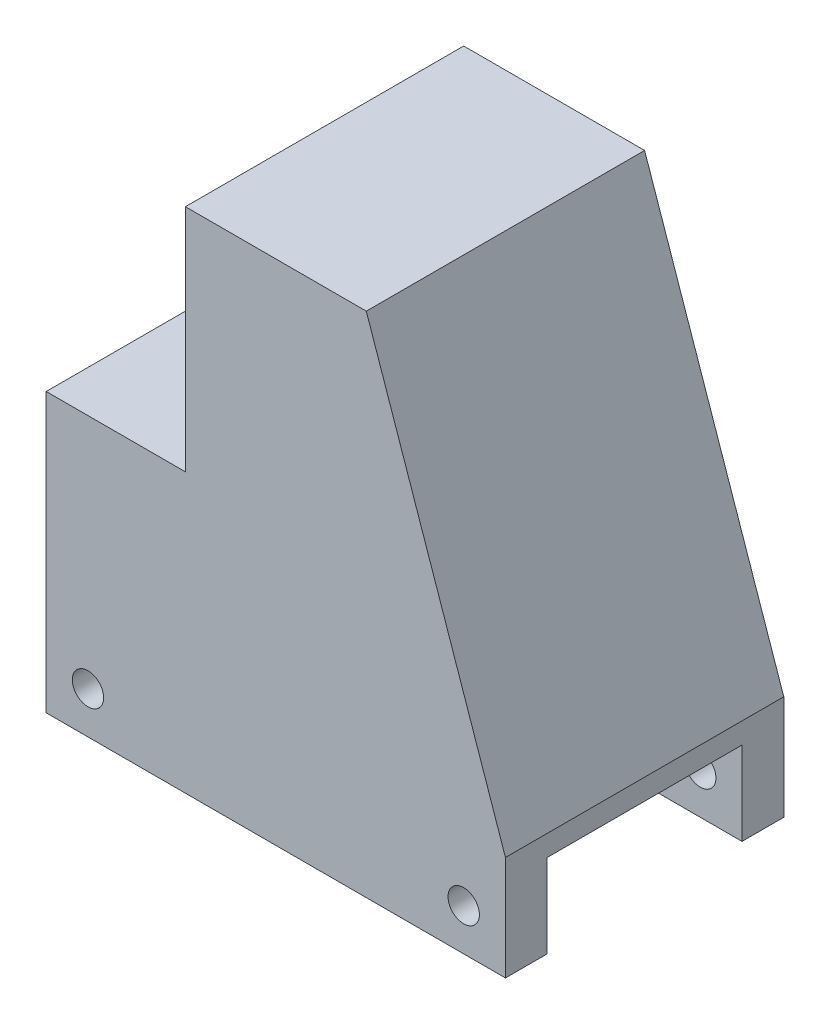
ISO-10303-21;
HEADER;
FILE_DESCRIPTION(('STEP AP214'),'2;1');
FILE_NAME('part.step','',(''),(''),'','','');
FILE_SCHEMA(('AUTOMOTIVE_DESIGN { 1 0 10303 214 1 1 1 1 }'));
ENDSEC;
DATA;
#1=APPLICATION_CONTEXT('core data for automotive mechanical design processes');
#2=APPLICATION_PROTOCOL_DEFINITION('international standard','automotive_design',2000,#1);
#3=PRODUCT_CONTEXT('',#1,'mechanical');
#4=PRODUCT('Part','Part','',(#3));
#5=PRODUCT_RELATED_PRODUCT_CATEGORY('part','',(#4));
#6=PRODUCT_DEFINITION_FORMATION('','',#4);
#7=PRODUCT_DEFINITION_CONTEXT('part definition',#1,'design');
#8=PRODUCT_DEFINITION('design','',#6,#7);
#9=PRODUCT_DEFINITION_SHAPE('','',#8);
#10=(LENGTH_UNIT() NAMED_UNIT(*) SI_UNIT(.MILLI.,.METRE.));
#11=(NAMED_UNIT(*) PLANE_ANGLE_UNIT() SI_UNIT($,.RADIAN.));
#12=(NAMED_UNIT(*) SI_UNIT($,.STERADIAN.) SOLID_ANGLE_UNIT());
#13=UNCERTAINTY_MEASURE_WITH_UNIT(LENGTH_MEASURE(1.E-05),#10,'distance_accuracy_value','');
#14=(GEOMETRIC_REPRESENTATION_CONTEXT(3) GLOBAL_UNCERTAINTY_ASSIGNED_CONTEXT((#13)) GLOBAL_UNIT_ASSIGNED_CONTEXT((#10,
#11,#12)) REPRESENTATION_CONTEXT('',''));
#15=CARTESIAN_POINT('',(0.,0.,0.));
#16=DIRECTION('',(0.,0.,1.));
#17=DIRECTION('',(1.,0.,0.));
#18=AXIS2_PLACEMENT_3D('',#15,#16,#17);
#19=CARTESIAN_POINT('',(-66.0000000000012,-9.99200722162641E-13,-40.0000000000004));
#20=DIRECTION('',(0.,-1.,0.));
#21=DIRECTION('',(0.,0.,-0.999999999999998));
#22=AXIS2_PLACEMENT_3D('',#19,#20,#21);
#23=PLANE('',#22);
#24=DIRECTION('',(-0.999999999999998,0.,0.));
#25=VECTOR('',#24,1.);
#26=CARTESIAN_POINT('',(0.,1.11022302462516E-13,-33.9999999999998));
#27=LINE('',#26,#25);
#28=CARTESIAN_POINT('',(0.,1.11022302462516E-13,-33.9999999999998));
#29=VERTEX_POINT('',#28);
#30=CARTESIAN_POINT('',(-66.0000000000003,-1.66533453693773E-12,-33.9999999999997));
#31=VERTEX_POINT('',#30);
#32=EDGE_CURVE('E133',#29,#31,#27,.T.);
#33=ORIENTED_EDGE('',*,*,#32,.T.);
#34=DIRECTION('',(0.,0.,0.999999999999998));
#35=VECTOR('',#34,1.);
#36=CARTESIAN_POINT('',(-66.0000000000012,-9.99200722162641E-13,-40.0000000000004));
#37=LINE('',#36,#35);
#38=CARTESIAN_POINT('',(-66.0000000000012,-9.99200722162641E-13,-40.0000000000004));
#39=VERTEX_POINT('',#38);
#40=EDGE_CURVE('E162',#39,#31,#37,.T.);
#41=ORIENTED_EDGE('',*,*,#40,.F.);
#42=DIRECTION('',(0.999999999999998,0.,0.));
#43=VECTOR('',#42,1.);
#44=CARTESIAN_POINT('',(-66.0000000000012,-9.99200722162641E-13,-40.0000000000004));
#45=LINE('',#44,#43);
#46=CARTESIAN_POINT('',(0.,-1.55431223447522E-12,-39.9999999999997));
#47=VERTEX_POINT('',#46);
#48=EDGE_CURVE('E156',#39,#47,#45,.T.);
#49=ORIENTED_EDGE('',*,*,#48,.T.);
#50=DIRECTION('',(0.,0.,0.999999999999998));
#51=VECTOR('',#50,1.);
#52=CARTESIAN_POINT('',(0.,-1.55431223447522E-12,-39.9999999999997));
#53=LINE('',#52,#51);
#54=EDGE_CURVE('E149',#47,#29,#53,.T.);
#55=ORIENTED_EDGE('',*,*,#54,.T.);
#56=EDGE_LOOP('',(#33,#41,#49,#55));
#57=FACE_BOUND('',#56,.T.);
#58=ADVANCED_FACE('F40',(#57),#23,.T.);
#59=CARTESIAN_POINT('',(-65.9999999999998,39.9999999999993,-39.9999999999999));
#60=DIRECTION('',(-0.999999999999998,0.,0.));
#61=DIRECTION('',(0.,0.,0.999999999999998));
#62=AXIS2_PLACEMENT_3D('',#59,#60,#61);
#63=PLANE('',#62);
#64=DIRECTION('',(0.,-1.,0.));
#65=VECTOR('',#64,1.);
#66=CARTESIAN_POINT('',(-66.0000000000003,-1.66533453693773E-12,-33.9999999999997));
#67=LINE('',#66,#65);
#68=CARTESIAN_POINT('',(-66.0000000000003,11.9999999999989,-33.9999999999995));
#69=VERTEX_POINT('',#68);
#70=EDGE_CURVE('E139',#69,#31,#67,.T.);
#71=ORIENTED_EDGE('',*,*,#70,.F.);
#72=DIRECTION('',(0.,0.,-0.999999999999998));
#73=VECTOR('',#72,1.);
#74=CARTESIAN_POINT('',(-66.0000000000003,11.9999999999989,-33.9999999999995));
#75=LINE('',#74,#73);
#76=CARTESIAN_POINT('',(-66.0000000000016,11.9999999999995,-5.99999999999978));
#77=VERTEX_POINT('',#76);
#78=EDGE_CURVE('E152',#77,#69,#75,.T.);
#79=ORIENTED_EDGE('',*,*,#78,.F.);
#80=DIRECTION('',(0.,1.,0.));
#81=VECTOR('',#80,1.);
#82=CARTESIAN_POINT('',(-66.0000000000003,-1.11022302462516E-13,-5.99999999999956));
#83=LINE('',#82,#81);
#84=CARTESIAN_POINT('',(-66.0000000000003,-1.11022302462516E-13,-5.99999999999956));
#85=VERTEX_POINT('',#84);
#86=EDGE_CURVE('E191',#85,#77,#83,.T.);
#87=ORIENTED_EDGE('',*,*,#86,.F.);
#88=CARTESIAN_POINT('',(-66.0000000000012,-1.33226762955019E-12,1.11022302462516E-13));
#89=VERTEX_POINT('',#88);
#90=EDGE_CURVE('E166',#85,#89,#37,.T.);
#91=ORIENTED_EDGE('',*,*,#90,.T.);
#92=DIRECTION('',(0.,-1.,0.));
#93=VECTOR('',#92,1.);
#94=CARTESIAN_POINT('',(-66.0000000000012,39.9999999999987,1.11022302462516E-13));
#95=LINE('',#94,#93);
#96=CARTESIAN_POINT('',(-66.0000000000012,39.9999999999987,1.11022302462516E-13));
#97=VERTEX_POINT('',#96);
#98=EDGE_CURVE('E210',#97,#89,#95,.T.);
#99=ORIENTED_EDGE('',*,*,#98,.F.);
#100=DIRECTION('',(0.,0.,0.999999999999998));
#101=VECTOR('',#100,1.);
#102=CARTESIAN_POINT('',(-65.9999999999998,39.9999999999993,-39.9999999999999));
#103=LINE('',#102,#101);
#104=CARTESIAN_POINT('',(-65.9999999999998,39.9999999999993,-39.9999999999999));
#105=VERTEX_POINT('',#104);
#106=EDGE_CURVE('E168',#105,#97,#103,.T.);
#107=ORIENTED_EDGE('',*,*,#106,.F.);
#108=DIRECTION('',(0.,-1.,0.));
#109=VECTOR('',#108,1.);
#110=CARTESIAN_POINT('',(-65.9999999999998,39.9999999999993,-39.9999999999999));
#111=LINE('',#110,#109);
#112=EDGE_CURVE('E211',#105,#39,#111,.T.);
#113=ORIENTED_EDGE('',*,*,#112,.T.);
#114=ORIENTED_EDGE('',*,*,#40,.T.);
#115=EDGE_LOOP('',(#71,#79,#87,#91,#99,#107,#113,#114));
#116=FACE_BOUND('',#115,.T.);
#117=ADVANCED_FACE('F279',(#116),#63,.T.);
#118=CARTESIAN_POINT('',(-46.0000000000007,39.9999999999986,-39.9999999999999));
#119=DIRECTION('',(0.,1.,0.));
#120=DIRECTION('',(0.,0.,0.999999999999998));
#121=AXIS2_PLACEMENT_3D('',#118,#119,#120);
#122=PLANE('',#121);
#123=CARTESIAN_POINT('',(-56.0000000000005,39.9999999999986,-19.9999999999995));
#124=DIRECTION('',(0.,1.,0.));
#125=DIRECTION('',(0.,0.,0.999999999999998));
#126=AXIS2_PLACEMENT_3D('',#123,#124,#125);
#127=CIRCLE('',#126,2.15);
#128=CARTESIAN_POINT('',(-56.0000000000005,39.9999999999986,-17.8499999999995));
#129=VERTEX_POINT('',#128);
#130=EDGE_CURVE('E11',#129,#129,#127,.F.);
#131=ORIENTED_EDGE('',*,*,#130,.T.);
#132=EDGE_LOOP('',(#131));
#133=FACE_BOUND('',#132,.T.);
#134=DIRECTION('',(-0.999999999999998,0.,0.));
#135=VECTOR('',#134,1.);
#136=CARTESIAN_POINT('',(-46.0000000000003,39.9999999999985,1.11022302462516E-13));
#137=LINE('',#136,#135);
#138=CARTESIAN_POINT('',(-46.0000000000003,39.9999999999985,1.11022302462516E-13));
#139=VERTEX_POINT('',#138);
#140=EDGE_CURVE('E214',#139,#97,#137,.T.);
#141=ORIENTED_EDGE('',*,*,#140,.F.);
#142=DIRECTION('',(0.,0.,0.999999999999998));
#143=VECTOR('',#142,1.);
#144=CARTESIAN_POINT('',(-46.0000000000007,39.9999999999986,-39.9999999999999));
#145=LINE('',#144,#143);
#146=CARTESIAN_POINT('',(-46.0000000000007,39.9999999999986,-39.9999999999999));
#147=VERTEX_POINT('',#146);
#148=EDGE_CURVE('E250',#147,#139,#145,.T.);
#149=ORIENTED_EDGE('',*,*,#148,.F.);
#150=DIRECTION('',(-0.999999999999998,0.,0.));
#151=VECTOR('',#150,1.);
#152=CARTESIAN_POINT('',(-46.0000000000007,39.9999999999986,-39.9999999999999));
#153=LINE('',#152,#151);
#154=EDGE_CURVE('E227',#147,#105,#153,.T.);
#155=ORIENTED_EDGE('',*,*,#154,.T.);
#156=ORIENTED_EDGE('',*,*,#106,.T.);
#157=EDGE_LOOP('',(#141,#149,#155,#156));
#158=FACE_BOUND('',#157,.T.);
#159=ADVANCED_FACE('F276',(#133,#158),#122,.T.);
#160=CARTESIAN_POINT('',(-46.0000000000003,72.9999999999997,-39.9999999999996));
#161=DIRECTION('',(-0.999999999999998,0.,0.));
#162=DIRECTION('',(0.,-0.999999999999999,0.));
#163=AXIS2_PLACEMENT_3D('',#160,#161,#162);
#164=PLANE('',#163);
#165=CARTESIAN_POINT('',(-46.0000000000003,58.9999999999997,-19.9999999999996));
#166=DIRECTION('',(-0.999999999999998,0.,0.));
#167=DIRECTION('',(0.,0.,0.999999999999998));
#168=AXIS2_PLACEMENT_3D('',#165,#166,#167);
#169=CIRCLE('',#168,10.6);
#170=CARTESIAN_POINT('',(-46.0000000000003,58.9999999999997,-9.39999999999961));
#171=VERTEX_POINT('',#170);
#172=EDGE_CURVE('E204',#171,#171,#169,.T.);
#173=ORIENTED_EDGE('',*,*,#172,.F.);
#174=EDGE_LOOP('',(#173));
#175=FACE_BOUND('',#174,.T.);
#176=DIRECTION('',(0.,-0.999999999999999,0.));
#177=VECTOR('',#176,1.);
#178=CARTESIAN_POINT('',(-46.0000000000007,72.9999999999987,0.));
#179=LINE('',#178,#177);
#180=CARTESIAN_POINT('',(-46.0000000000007,72.9999999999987,0.));
#181=VERTEX_POINT('',#180);
#182=EDGE_CURVE('E244',#181,#139,#179,.T.);
#183=ORIENTED_EDGE('',*,*,#182,.F.);
#184=DIRECTION('',(0.,0.,0.999999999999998));
#185=VECTOR('',#184,1.);
#186=CARTESIAN_POINT('',(-46.0000000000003,72.9999999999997,-39.9999999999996));
#187=LINE('',#186,#185);
#188=CARTESIAN_POINT('',(-46.0000000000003,72.9999999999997,-39.9999999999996));
#189=VERTEX_POINT('',#188);
#190=EDGE_CURVE('E252',#189,#181,#187,.T.);
#191=ORIENTED_EDGE('',*,*,#190,.F.);
#192=DIRECTION('',(0.,-0.999999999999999,0.));
#193=VECTOR('',#192,1.);
#194=CARTESIAN_POINT('',(-46.0000000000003,72.9999999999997,-39.9999999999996));
#195=LINE('',#194,#193);
#196=EDGE_CURVE('E224',#189,#147,#195,.T.);
#197=ORIENTED_EDGE('',*,*,#196,.T.);
#198=ORIENTED_EDGE('',*,*,#148,.T.);
#199=EDGE_LOOP('',(#183,#191,#197,#198));
#200=FACE_BOUND('',#199,.T.);
#201=ADVANCED_FACE('F273',(#175,#200),#164,.T.);
#202=CARTESIAN_POINT('',(-20.0000000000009,72.9999999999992,-39.9999999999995));
#203=DIRECTION('',(0.,1.,0.));
#204=DIRECTION('',(0.,0.,0.999999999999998));
#205=AXIS2_PLACEMENT_3D('',#202,#203,#204);
#206=PLANE('',#205);
#207=DIRECTION('',(-0.999999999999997,0.,0.));
#208=VECTOR('',#207,1.);
#209=CARTESIAN_POINT('',(-20.,72.9999999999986,6.66133814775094E-13));
#210=LINE('',#209,#208);
#211=CARTESIAN_POINT('',(-20.,72.9999999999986,6.66133814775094E-13));
#212=VERTEX_POINT('',#211);
#213=EDGE_CURVE('E241',#212,#181,#210,.T.);
#214=ORIENTED_EDGE('',*,*,#213,.F.);
#215=DIRECTION('',(0.,0.,0.999999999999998));
#216=VECTOR('',#215,1.);
#217=CARTESIAN_POINT('',(-20.0000000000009,72.9999999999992,-39.9999999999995));
#218=LINE('',#217,#216);
#219=CARTESIAN_POINT('',(-20.0000000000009,72.9999999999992,-39.9999999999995));
#220=VERTEX_POINT('',#219);
#221=EDGE_CURVE('E160',#220,#212,#218,.T.);
#222=ORIENTED_EDGE('',*,*,#221,.F.);
#223=DIRECTION('',(-0.999999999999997,0.,0.));
#224=VECTOR('',#223,1.);
#225=CARTESIAN_POINT('',(-20.0000000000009,72.9999999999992,-39.9999999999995));
#226=LINE('',#225,#224);
#227=EDGE_CURVE('E221',#220,#189,#226,.T.);
#228=ORIENTED_EDGE('',*,*,#227,.T.);
#229=ORIENTED_EDGE('',*,*,#190,.T.);
#230=EDGE_LOOP('',(#214,#222,#228,#229));
#231=FACE_BOUND('',#230,.T.);
#232=ADVANCED_FACE('F260',(#231),#206,.T.);
#233=CARTESIAN_POINT('',(0.,14.9999999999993,-40.));
#234=DIRECTION('',(0.94537298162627,0.325990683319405,0.));
#235=DIRECTION('',(-0.325990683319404,0.945372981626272,0.));
#236=AXIS2_PLACEMENT_3D('',#233,#234,#235);
#237=PLANE('',#236);
#238=DIRECTION('',(-0.325990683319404,0.945372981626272,0.));
#239=VECTOR('',#238,1.);
#240=CARTESIAN_POINT('',(4.44089209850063E-13,14.9999999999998,6.66133814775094E-13));
#241=LINE('',#240,#239);
#242=CARTESIAN_POINT('',(4.44089209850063E-13,14.9999999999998,6.66133814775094E-13));
#243=VERTEX_POINT('',#242);
#244=EDGE_CURVE('E238',#243,#212,#241,.T.);
#245=ORIENTED_EDGE('',*,*,#244,.F.);
#246=DIRECTION('',(0.,0.,0.999999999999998));
#247=VECTOR('',#246,1.);
#248=CARTESIAN_POINT('',(0.,14.9999999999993,-40.));
#249=LINE('',#248,#247);
#250=CARTESIAN_POINT('',(0.,14.9999999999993,-40.));
#251=VERTEX_POINT('',#250);
#252=EDGE_CURVE('E157',#251,#243,#249,.T.);
#253=ORIENTED_EDGE('',*,*,#252,.F.);
#254=DIRECTION('',(-0.325990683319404,0.945372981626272,0.));
#255=VECTOR('',#254,1.);
#256=CARTESIAN_POINT('',(0.,14.9999999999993,-40.));
#257=LINE('',#256,#255);
#258=EDGE_CURVE('E218',#251,#220,#257,.T.);
#259=ORIENTED_EDGE('',*,*,#258,.T.);
#260=ORIENTED_EDGE('',*,*,#221,.T.);
#261=EDGE_LOOP('',(#245,#253,#259,#260));
#262=FACE_BOUND('',#261,.T.);
#263=ADVANCED_FACE('F256',(#262),#237,.T.);
#264=CARTESIAN_POINT('',(0.,-1.55431223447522E-12,-39.9999999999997));
#265=DIRECTION('',(0.999999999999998,0.,0.));
#266=DIRECTION('',(0.,0.,-0.999999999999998));
#267=AXIS2_PLACEMENT_3D('',#264,#265,#266);
#268=PLANE('',#267);
#269=DIRECTION('',(0.,-1.,0.));
#270=VECTOR('',#269,1.);
#271=CARTESIAN_POINT('',(0.,1.11022302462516E-13,-33.9999999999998));
#272=LINE('',#271,#270);
#273=CARTESIAN_POINT('',(-4.44089209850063E-13,11.9999999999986,-33.9999999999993));
#274=VERTEX_POINT('',#273);
#275=EDGE_CURVE('E136',#274,#29,#272,.T.);
#276=ORIENTED_EDGE('',*,*,#275,.T.);
#277=ORIENTED_EDGE('',*,*,#54,.F.);
#278=DIRECTION('',(0.,1.,0.));
#279=VECTOR('',#278,1.);
#280=CARTESIAN_POINT('',(0.,-1.55431223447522E-12,-39.9999999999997));
#281=LINE('',#280,#279);
#282=EDGE_CURVE('E216',#47,#251,#281,.T.);
#283=ORIENTED_EDGE('',*,*,#282,.T.);
#284=ORIENTED_EDGE('',*,*,#252,.T.);
#285=DIRECTION('',(0.,1.,0.));
#286=VECTOR('',#285,1.);
#287=CARTESIAN_POINT('',(0.,0.,0.));
#288=LINE('',#287,#286);
#289=CARTESIAN_POINT('',(0.,0.,0.));
#290=VERTEX_POINT('',#289);
#291=EDGE_CURVE('E235',#290,#243,#288,.T.);
#292=ORIENTED_EDGE('',*,*,#291,.F.);
#293=CARTESIAN_POINT('',(0.,0.,-6.00000000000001));
#294=VERTEX_POINT('',#293);
#295=EDGE_CURVE('E158',#294,#290,#53,.T.);
#296=ORIENTED_EDGE('',*,*,#295,.F.);
#297=DIRECTION('',(0.,1.,0.));
#298=VECTOR('',#297,1.);
#299=CARTESIAN_POINT('',(0.,0.,-6.00000000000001));
#300=LINE('',#299,#298);
#301=CARTESIAN_POINT('',(0.,11.9999999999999,-6.00000000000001));
#302=VERTEX_POINT('',#301);
#303=EDGE_CURVE('E62',#294,#302,#300,.T.);
#304=ORIENTED_EDGE('',*,*,#303,.T.);
#305=DIRECTION('',(0.,0.,-0.999999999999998));
#306=VECTOR('',#305,1.);
#307=CARTESIAN_POINT('',(-4.44089209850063E-13,11.9999999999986,-33.9999999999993));
#308=LINE('',#307,#306);
#309=EDGE_CURVE('E144',#302,#274,#308,.T.);
#310=ORIENTED_EDGE('',*,*,#309,.T.);
#311=EDGE_LOOP('',(#276,#277,#283,#284,#292,#296,#304,#310));
#312=FACE_BOUND('',#311,.T.);
#313=ADVANCED_FACE('F147',(#312),#268,.T.);
#314=DIRECTION('',(-0.999999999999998,0.,0.));
#315=VECTOR('',#314,1.);
#316=CARTESIAN_POINT('',(0.,0.,-6.00000000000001));
#317=LINE('',#316,#315);
#318=EDGE_CURVE('E143',#294,#85,#317,.T.);
#319=ORIENTED_EDGE('',*,*,#318,.F.);
#320=ORIENTED_EDGE('',*,*,#295,.T.);
#321=DIRECTION('',(0.999999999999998,0.,0.));
#322=VECTOR('',#321,1.);
#323=CARTESIAN_POINT('',(-66.0000000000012,-1.33226762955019E-12,1.11022302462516E-13));
#324=LINE('',#323,#322);
#325=EDGE_CURVE('E232',#89,#290,#324,.T.);
#326=ORIENTED_EDGE('',*,*,#325,.F.);
#327=ORIENTED_EDGE('',*,*,#90,.F.);
#328=EDGE_LOOP('',(#319,#320,#326,#327));
#329=FACE_BOUND('',#328,.T.);
#330=ADVANCED_FACE('F284',(#329),#23,.T.);
#331=CARTESIAN_POINT('',(0.,-1.55431223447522E-12,-39.9999999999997));
#332=DIRECTION('',(0.,0.,0.999999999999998));
#333=DIRECTION('',(0.999999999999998,0.,0.));
#334=AXIS2_PLACEMENT_3D('',#331,#332,#333);
#335=PLANE('',#334);
#336=CARTESIAN_POINT('',(-60.0000000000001,5.99999999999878,-40.));
#337=DIRECTION('',(0.,0.,0.999999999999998));
#338=DIRECTION('',(0.999999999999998,0.,0.));
#339=AXIS2_PLACEMENT_3D('',#336,#337,#338);
#340=CIRCLE('',#339,2.25);
#341=CARTESIAN_POINT('',(-57.7500000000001,5.99999999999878,-40.));
#342=VERTEX_POINT('',#341);
#343=EDGE_CURVE('E420',#342,#342,#340,.T.);
#344=ORIENTED_EDGE('',*,*,#343,.T.);
#345=EDGE_LOOP('',(#344));
#346=FACE_BOUND('',#345,.T.);
#347=CARTESIAN_POINT('',(-6.00000000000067,5.99999999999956,-39.9999999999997));
#348=DIRECTION('',(0.,0.,0.999999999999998));
#349=DIRECTION('',(0.999999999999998,0.,0.));
#350=AXIS2_PLACEMENT_3D('',#347,#348,#349);
#351=CIRCLE('',#350,2.25);
#352=CARTESIAN_POINT('',(-3.75000000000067,5.99999999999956,-39.9999999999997));
#353=VERTEX_POINT('',#352);
#354=EDGE_CURVE('E172',#353,#353,#351,.T.);
#355=ORIENTED_EDGE('',*,*,#354,.T.);
#356=EDGE_LOOP('',(#355));
#357=FACE_BOUND('',#356,.T.);
#358=ORIENTED_EDGE('',*,*,#112,.F.);
#359=ORIENTED_EDGE('',*,*,#154,.F.);
#360=ORIENTED_EDGE('',*,*,#196,.F.);
#361=ORIENTED_EDGE('',*,*,#227,.F.);
#362=ORIENTED_EDGE('',*,*,#258,.F.);
#363=ORIENTED_EDGE('',*,*,#282,.F.);
#364=ORIENTED_EDGE('',*,*,#48,.F.);
#365=EDGE_LOOP('',(#358,#359,#360,#361,#362,#363,#364));
#366=FACE_BOUND('',#365,.T.);
#367=ADVANCED_FACE('F269',(#346,#357,#366),#335,.F.);
#368=CARTESIAN_POINT('',(0.,0.,0.));
#369=DIRECTION('',(0.,0.,0.999999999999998));
#370=DIRECTION('',(0.999999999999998,0.,0.));
#371=AXIS2_PLACEMENT_3D('',#368,#369,#370);
#372=PLANE('',#371);
#373=CARTESIAN_POINT('',(-60.0000000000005,5.99999999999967,-2.22044604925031E-13));
#374=DIRECTION('',(0.,0.,0.999999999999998));
#375=DIRECTION('',(0.999999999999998,0.,0.));
#376=AXIS2_PLACEMENT_3D('',#373,#374,#375);
#377=CIRCLE('',#376,2.25);
#378=CARTESIAN_POINT('',(-57.7500000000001,5.99999999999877,-2.28983498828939E-13));
#379=VERTEX_POINT('',#378);
#380=EDGE_CURVE('E419',#379,#379,#377,.T.);
#381=ORIENTED_EDGE('',*,*,#380,.F.);
#382=EDGE_LOOP('',(#381));
#383=FACE_BOUND('',#382,.T.);
#384=CARTESIAN_POINT('',(-6.00000000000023,6.00000000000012,5.55111512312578E-13));
#385=DIRECTION('',(0.,0.,0.999999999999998));
#386=DIRECTION('',(0.999999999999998,0.,0.));
#387=AXIS2_PLACEMENT_3D('',#384,#385,#386);
#388=CIRCLE('',#387,2.25);
#389=CARTESIAN_POINT('',(-3.75000000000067,5.99999999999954,5.48172618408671E-13));
#390=VERTEX_POINT('',#389);
#391=EDGE_CURVE('E178',#390,#390,#388,.T.);
#392=ORIENTED_EDGE('',*,*,#391,.F.);
#393=EDGE_LOOP('',(#392));
#394=FACE_BOUND('',#393,.T.);
#395=ORIENTED_EDGE('',*,*,#98,.T.);
#396=ORIENTED_EDGE('',*,*,#325,.T.);
#397=ORIENTED_EDGE('',*,*,#291,.T.);
#398=ORIENTED_EDGE('',*,*,#244,.T.);
#399=ORIENTED_EDGE('',*,*,#213,.T.);
#400=ORIENTED_EDGE('',*,*,#182,.T.);
#401=ORIENTED_EDGE('',*,*,#140,.T.);
#402=EDGE_LOOP('',(#395,#396,#397,#398,#399,#400,#401));
#403=FACE_BOUND('',#402,.T.);
#404=ADVANCED_FACE('F263',(#383,#394,#403),#372,.T.);
#405=CARTESIAN_POINT('',(-25.0000000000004,58.9999999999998,-19.9999999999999));
#406=DIRECTION('',(-0.999999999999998,0.,0.));
#407=DIRECTION('',(0.,0.,0.999999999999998));
#408=AXIS2_PLACEMENT_3D('',#405,#406,#407);
#409=CONICAL_SURFACE('',#408,10.6,1.02974425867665);
#410=CARTESIAN_POINT('',(-18.6308774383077,58.9999999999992,-19.9999999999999));
#411=VERTEX_POINT('',#410);
#412=VERTEX_LOOP('',#411);
#413=FACE_BOUND('',#412,.T.);
#414=CARTESIAN_POINT('',(-25.0000000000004,58.9999999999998,-19.9999999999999));
#415=DIRECTION('',(-0.999999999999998,0.,0.));
#416=DIRECTION('',(0.,0.,0.999999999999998));
#417=AXIS2_PLACEMENT_3D('',#414,#415,#416);
#418=CIRCLE('',#417,10.6);
#419=CARTESIAN_POINT('',(-25.0000000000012,48.3999999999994,-19.9999999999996));
#420=VERTEX_POINT('',#419);
#421=EDGE_CURVE('E207',#420,#420,#418,.T.);
#422=ORIENTED_EDGE('',*,*,#421,.T.);
#423=EDGE_LOOP('',(#422));
#424=FACE_BOUND('',#423,.T.);
#425=ADVANCED_FACE('F329',(#413,#424),#409,.F.);
#426=CARTESIAN_POINT('',(-46.0000000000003,58.9999999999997,-19.9999999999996));
#427=DIRECTION('',(-0.999999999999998,0.,0.));
#428=DIRECTION('',(0.,0.,0.999999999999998));
#429=AXIS2_PLACEMENT_3D('',#426,#427,#428);
#430=CYLINDRICAL_SURFACE('',#429,10.6);
#431=ORIENTED_EDGE('',*,*,#421,.F.);
#432=CARTESIAN_POINT('',(-33.0000000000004,52.0458645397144,-27.9999999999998));
#433=CARTESIAN_POINT('',(-33.1861628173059,52.0458695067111,-28.0000023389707));
#434=CARTESIAN_POINT('',(-33.3723036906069,52.0383505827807,-27.9934863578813));
#435=CARTESIAN_POINT('',(-33.742597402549,52.00876425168,-27.9676224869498));
#436=CARTESIAN_POINT('',(-33.9267492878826,51.9866901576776,-27.94826869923));
#437=CARTESIAN_POINT('',(-34.2916860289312,51.9292246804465,-27.8971894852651));
#438=CARTESIAN_POINT('',(-34.4724606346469,51.8937980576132,-27.8654313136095));
#439=CARTESIAN_POINT('',(-34.8289954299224,51.8114612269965,-27.7902509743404));
#440=CARTESIAN_POINT('',(-35.0047515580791,51.7645419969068,-27.7468196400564));
#441=CARTESIAN_POINT('',(-35.3853464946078,51.6508140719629,-27.6391598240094));
#442=CARTESIAN_POINT('',(-35.5888655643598,51.5819017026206,-27.5725007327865));
#443=CARTESIAN_POINT('',(-35.9865800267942,51.4339201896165,-27.4246458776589));
#444=CARTESIAN_POINT('',(-36.1807770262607,51.3548528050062,-27.3434526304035));
#445=CARTESIAN_POINT('',(-36.5599095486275,51.189505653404,-27.1673414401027));
#446=CARTESIAN_POINT('',(-36.744834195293,51.1032177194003,-27.0724078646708));
#447=CARTESIAN_POINT('',(-37.1051019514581,50.9261374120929,-26.8695612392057));
#448=CARTESIAN_POINT('',(-37.2804458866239,50.8353454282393,-26.7616493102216));
#449=CARTESIAN_POINT('',(-37.6253867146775,50.6493936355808,-26.5306856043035));
#450=CARTESIAN_POINT('',(-37.7947616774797,50.5541814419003,-26.4073449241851));
#451=CARTESIAN_POINT('',(-38.1232387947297,50.3634670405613,-26.1478638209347));
#452=CARTESIAN_POINT('',(-38.2823406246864,50.2679648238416,-26.0117229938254));
#453=CARTESIAN_POINT('',(-38.5897503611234,50.0786399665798,-25.7270008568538));
#454=CARTESIAN_POINT('',(-38.7380680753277,49.9848158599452,-25.5784311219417));
#455=CARTESIAN_POINT('',(-39.0235287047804,49.8004879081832,-25.268911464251));
#456=CARTESIAN_POINT('',(-39.1606693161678,49.7099847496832,-25.1079590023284));
#457=CARTESIAN_POINT('',(-39.4175109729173,49.5376659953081,-24.7808962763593));
#458=CARTESIAN_POINT('',(-39.5376996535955,49.4556457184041,-24.6152775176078));
#459=CARTESIAN_POINT('',(-39.7662071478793,49.2976938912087,-24.2732580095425));
#460=CARTESIAN_POINT('',(-39.8745256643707,49.2217624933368,-24.0968569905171));
#461=CARTESIAN_POINT('',(-40.0783049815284,49.0774384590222,-23.7337570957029));
#462=CARTESIAN_POINT('',(-40.1737632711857,49.0090472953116,-23.5470562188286));
#463=CARTESIAN_POINT('',(-40.3506460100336,48.8812917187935,-23.1642428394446));
#464=CARTESIAN_POINT('',(-40.4320770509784,48.8219230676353,-22.9681348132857));
#465=CARTESIAN_POINT('',(-40.5805070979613,48.7130413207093,-22.5656090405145));
#466=CARTESIAN_POINT('',(-40.6473627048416,48.6636264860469,-22.3591114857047));
#467=CARTESIAN_POINT('',(-40.7645206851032,48.576649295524,-21.9390102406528));
#468=CARTESIAN_POINT('',(-40.8148228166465,48.5390871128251,-21.7254064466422));
#469=CARTESIAN_POINT('',(-40.8978525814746,48.4769149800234,-21.2931746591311));
#470=CARTESIAN_POINT('',(-40.9305983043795,48.4522916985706,-21.0745520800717));
#471=CARTESIAN_POINT('',(-40.9778888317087,48.4166893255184,-20.6342595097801));
#472=CARTESIAN_POINT('',(-40.9924368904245,48.4057077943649,-20.4125900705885));
#473=CARTESIAN_POINT('',(-41.002216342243,48.3983272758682,-20.0023798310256));
#474=CARTESIAN_POINT('',(-41.0000497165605,48.3999639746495,-19.8139294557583));
#475=CARTESIAN_POINT('',(-40.9824530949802,48.4132383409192,-19.4380037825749));
#476=CARTESIAN_POINT('',(-40.967023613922,48.4248756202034,-19.2505284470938));
#477=CARTESIAN_POINT('',(-40.9231483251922,48.4578905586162,-18.8779919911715));
#478=CARTESIAN_POINT('',(-40.894702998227,48.4792678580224,-18.6929307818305));
#479=CARTESIAN_POINT('',(-40.8252307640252,48.5312986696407,-18.3265185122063));
#480=CARTESIAN_POINT('',(-40.7842035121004,48.561952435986,-18.1451675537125));
#481=CARTESIAN_POINT('',(-40.6915636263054,48.6308524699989,-17.7927316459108));
#482=CARTESIAN_POINT('',(-40.6403082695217,48.6688413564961,-17.6215020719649));
#483=CARTESIAN_POINT('',(-40.5271150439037,48.752268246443,-17.2844553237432));
#484=CARTESIAN_POINT('',(-40.4651737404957,48.7977086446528,-17.1186399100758));
#485=CARTESIAN_POINT('',(-40.2643175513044,48.9440647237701,-16.6305329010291));
#486=CARTESIAN_POINT('',(-40.1103017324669,49.0550671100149,-16.3173240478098));
#487=CARTESIAN_POINT('',(-39.7446801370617,49.3133191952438,-15.6800754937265));
#488=CARTESIAN_POINT('',(-39.5281564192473,49.4634192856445,-15.3600619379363));
#489=CARTESIAN_POINT('',(-39.0561194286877,49.7801418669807,-14.7588449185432));
#490=CARTESIAN_POINT('',(-38.8005595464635,49.9467840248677,-14.4776886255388));
#491=CARTESIAN_POINT('',(-38.3637209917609,50.2185929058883,-14.060135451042));
#492=CARTESIAN_POINT('',(-38.1934341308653,50.3217892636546,-13.9107059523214));
#493=CARTESIAN_POINT('',(-37.8407208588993,50.5281592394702,-13.6267207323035));
#494=CARTESIAN_POINT('',(-37.658291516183,50.6313328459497,-13.492168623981));
#495=CARTESIAN_POINT('',(-37.2816605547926,50.8349820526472,-13.2384208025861));
#496=CARTESIAN_POINT('',(-37.0874600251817,50.9354579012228,-13.1192236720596));
#497=CARTESIAN_POINT('',(-36.6874019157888,51.1306637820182,-12.8968025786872));
#498=CARTESIAN_POINT('',(-36.4815486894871,51.22539593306,-12.7935727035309));
#499=CARTESIAN_POINT('',(-36.1177155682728,51.3802097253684,-12.6306270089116));
#500=CARTESIAN_POINT('',(-35.9625174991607,51.4425535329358,-12.5668305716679));
#501=CARTESIAN_POINT('',(-35.6461998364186,51.5608565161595,-12.4484342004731));
#502=CARTESIAN_POINT('',(-35.4850787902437,51.6168141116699,-12.3938365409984));
#503=CARTESIAN_POINT('',(-35.1575758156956,51.7205039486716,-12.294541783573));
#504=CARTESIAN_POINT('',(-34.9912046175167,51.7682518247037,-12.2498258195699));
#505=CARTESIAN_POINT('',(-34.6535742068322,51.8538341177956,-12.1708421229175));
#506=CARTESIAN_POINT('',(-34.4823182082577,51.8916748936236,-12.1365676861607));
#507=CARTESIAN_POINT('',(-34.1619749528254,51.9509373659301,-12.0834318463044));
#508=CARTESIAN_POINT('',(-34.0134431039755,51.9739752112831,-12.0630248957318));
#509=CARTESIAN_POINT('',(-33.7143871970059,52.0108402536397,-12.0305423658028));
#510=CARTESIAN_POINT('',(-33.5638640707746,52.0246716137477,-12.0184630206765));
#511=CARTESIAN_POINT('',(-33.2618540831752,52.0425680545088,-12.0028577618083));
#512=CARTESIAN_POINT('',(-33.1103676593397,52.0466372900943,-11.9993282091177));
#513=CARTESIAN_POINT('',(-32.8074957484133,52.0448492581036,-12.0008826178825));
#514=CARTESIAN_POINT('',(-32.6561102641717,52.0389917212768,-12.0059668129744));
#515=CARTESIAN_POINT('',(-32.354919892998,52.0176205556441,-12.0246268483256));
#516=CARTESIAN_POINT('',(-32.2051120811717,52.0021301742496,-12.0381822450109));
#517=CARTESIAN_POINT('',(-31.9076734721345,51.9621447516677,-12.0735069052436));
#518=CARTESIAN_POINT('',(-31.7600434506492,51.9376465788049,-12.095279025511));
#519=CARTESIAN_POINT('',(-31.3213276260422,51.85186421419,-12.1724758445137));
#520=CARTESIAN_POINT('',(-31.0346000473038,51.7783069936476,-12.2397689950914));
#521=CARTESIAN_POINT('',(-30.5501550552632,51.6295794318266,-12.381309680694));
#522=CARTESIAN_POINT('',(-30.3487431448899,51.5598441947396,-12.4491545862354));
#523=CARTESIAN_POINT('',(-29.955021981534,51.4106151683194,-12.5991596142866));
#524=CARTESIAN_POINT('',(-29.7627143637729,51.3311196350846,-12.6813222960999));
#525=CARTESIAN_POINT('',(-29.3871524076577,51.1651928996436,-12.8592283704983));
#526=CARTESIAN_POINT('',(-29.2039162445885,51.0787486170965,-12.9549976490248));
#527=CARTESIAN_POINT('',(-28.8469494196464,50.9016154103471,-13.1593528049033));
#528=CARTESIAN_POINT('',(-28.6732175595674,50.8109270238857,-13.2679370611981));
#529=CARTESIAN_POINT('',(-28.3291208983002,50.6241133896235,-13.5017136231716));
#530=CARTESIAN_POINT('',(-28.1591129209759,50.5279107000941,-13.6273687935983));
#531=CARTESIAN_POINT('',(-27.8295833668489,50.3353976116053,-13.8916938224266));
#532=CARTESIAN_POINT('',(-27.6700623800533,50.2390872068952,-14.030364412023));
#533=CARTESIAN_POINT('',(-27.3620826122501,50.0483792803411,-14.3203370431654));
#534=CARTESIAN_POINT('',(-27.2136124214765,49.9539798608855,-14.4716257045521));
#535=CARTESIAN_POINT('',(-26.9281314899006,49.7687600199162,-14.7867839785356));
#536=CARTESIAN_POINT('',(-26.7911230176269,49.6779403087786,-14.9506560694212));
#537=CARTESIAN_POINT('',(-26.5367878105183,49.5065922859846,-15.2811147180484));
#538=CARTESIAN_POINT('',(-26.4187876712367,49.425772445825,-15.4470310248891));
#539=CARTESIAN_POINT('',(-26.1946202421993,49.2703199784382,-15.7894564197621));
#540=CARTESIAN_POINT('',(-26.0884531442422,49.1956874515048,-15.9659656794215));
#541=CARTESIAN_POINT('',(-25.8889395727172,49.0540336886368,-16.3290693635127));
#542=CARTESIAN_POINT('',(-25.7955949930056,48.9870135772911,-16.5156652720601));
#543=CARTESIAN_POINT('',(-25.6228815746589,48.8620354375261,-16.8980478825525));
#544=CARTESIAN_POINT('',(-25.5435062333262,48.8040731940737,-17.093830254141));
#545=CARTESIAN_POINT('',(-25.3991400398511,48.6980268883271,-17.4954301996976));
#546=CARTESIAN_POINT('',(-25.3342892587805,48.6500393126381,-17.7013239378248));
#547=CARTESIAN_POINT('',(-25.2210228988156,48.5658710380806,-18.1199660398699));
#548=CARTESIAN_POINT('',(-25.1726075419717,48.5296904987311,-18.3327144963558));
#549=CARTESIAN_POINT('',(-25.0931895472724,48.4701870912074,-18.7630026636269));
#550=CARTESIAN_POINT('',(-25.0621700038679,48.4468517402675,-18.9805375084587));
#551=CARTESIAN_POINT('',(-25.0181347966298,48.4136900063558,-19.4184300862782));
#552=CARTESIAN_POINT('',(-25.0051160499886,48.4038613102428,-19.6387873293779));
#553=CARTESIAN_POINT('',(-24.9979344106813,48.3984408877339,-20.0470822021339));
#554=CARTESIAN_POINT('',(-25.0012504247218,48.40094560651,-20.2349568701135));
#555=CARTESIAN_POINT('',(-25.0210556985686,48.4158841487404,-20.6096130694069));
#556=CARTESIAN_POINT('',(-25.0375445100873,48.4283176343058,-20.7963946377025));
#557=CARTESIAN_POINT('',(-25.0834338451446,48.4628375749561,-21.1674463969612));
#558=CARTESIAN_POINT('',(-25.1128340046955,48.4849237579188,-21.3517166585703));
#559=CARTESIAN_POINT('',(-25.1841018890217,48.5382742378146,-21.7164713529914));
#560=CARTESIAN_POINT('',(-25.2259699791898,48.5695388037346,-21.8969556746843));
#561=CARTESIAN_POINT('',(-25.3203453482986,48.6396851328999,-22.2483613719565));
#562=CARTESIAN_POINT('',(-25.3725460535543,48.678346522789,-22.41940939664));
#563=CARTESIAN_POINT('',(-25.4876066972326,48.763079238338,-22.756015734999));
#564=CARTESIAN_POINT('',(-25.5504700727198,48.8091529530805,-22.9215722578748));
#565=CARTESIAN_POINT('',(-25.7540488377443,48.9573368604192,-23.4088005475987));
#566=CARTESIAN_POINT('',(-25.9098234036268,49.0694630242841,-23.7212890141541));
#567=CARTESIAN_POINT('',(-26.2794916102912,49.3301610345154,-24.3575225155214));
#568=CARTESIAN_POINT('',(-26.4983823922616,49.4816057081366,-24.6771369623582));
#569=CARTESIAN_POINT('',(-26.9752275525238,49.8007436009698,-25.2772365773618));
#570=CARTESIAN_POINT('',(-27.2332312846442,49.9684572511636,-25.5576714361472));
#571=CARTESIAN_POINT('',(-27.6740889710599,50.2416583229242,-25.9738176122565));
#572=CARTESIAN_POINT('',(-27.8459162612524,50.3453083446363,-26.1226661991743));
#573=CARTESIAN_POINT('',(-28.2017647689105,50.5523920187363,-26.4053562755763));
#574=CARTESIAN_POINT('',(-28.3857890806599,50.6558256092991,-26.5391939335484));
#575=CARTESIAN_POINT('',(-28.7656888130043,50.8597470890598,-26.7913595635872));
#576=CARTESIAN_POINT('',(-28.9615619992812,50.9602355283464,-26.909690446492));
#577=CARTESIAN_POINT('',(-29.3649416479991,51.1551006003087,-27.1301618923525));
#578=CARTESIAN_POINT('',(-29.5724432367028,51.2494797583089,-27.2323091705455));
#579=CARTESIAN_POINT('',(-30.0859645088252,51.4649178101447,-27.4575874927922));
#580=CARTESIAN_POINT('',(-30.3978073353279,51.5812719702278,-27.5724256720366));
#581=CARTESIAN_POINT('',(-30.8809462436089,51.7317765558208,-27.7160727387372));
#582=CARTESIAN_POINT('',(-31.0443909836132,51.7779075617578,-27.7591590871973));
#583=CARTESIAN_POINT('',(-31.3759700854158,51.8605530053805,-27.8352689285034));
#584=CARTESIAN_POINT('',(-31.5441026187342,51.8970711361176,-27.8682962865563));
#585=CARTESIAN_POINT('',(-31.9244017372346,51.9662056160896,-27.9302216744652));
#586=CARTESIAN_POINT('',(-32.1375883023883,51.9958625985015,-27.9563013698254));
#587=CARTESIAN_POINT('',(-32.5671934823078,52.035687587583,-27.9911877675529));
#588=CARTESIAN_POINT('',(-32.7836115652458,52.0458587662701,-27.9999972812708));
#589=CARTESIAN_POINT('',(-33.0000000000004,52.0458645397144,-27.9999999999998));
#590=B_SPLINE_CURVE_WITH_KNOTS('',3,(#432,#433,#434,#435,#436,#437,#438,#439,#440,#441,#442,
#443,#444,#445,#446,#447,#448,#449,#450,#451,#452,#453,#454,#455,#456,#457,#458,#459,#460,#461,
#462,#463,#464,#465,#466,#467,#468,#469,#470,#471,#472,#473,#474,#475,#476,#477,#478,#479,#480,
#481,#482,#483,#484,#485,#486,#487,#488,#489,#490,#491,#492,#493,#494,#495,#496,#497,#498,#499,
#500,#501,#502,#503,#504,#505,#506,#507,#508,#509,#510,#511,#512,#513,#514,#515,#516,#517,#518,
#519,#520,#521,#522,#523,#524,#525,#526,#527,#528,#529,#530,#531,#532,#533,#534,#535,#536,#537,
#538,#539,#540,#541,#542,#543,#544,#545,#546,#547,#548,#549,#550,#551,#552,#553,#554,#555,#556,
#557,#558,#559,#560,#561,#562,#563,#564,#565,#566,#567,#568,#569,#570,#571,#572,#573,#574,#575,
#576,#577,#578,#579,#580,#581,#582,#583,#584,#585,#586,#587,#588,#589),.UNSPECIFIED.,.T.,.F.,(4,
2,2,2,2,2,2,2,2,2,2,2,2,2,2,2,2,2,2,2,2,2,2,2,2,2,2,2,2,2,2,2,2,2,2,2,2,2,2,2,2,2,2,2,2,2,2,2,2,
2,2,2,2,2,2,2,2,2,2,2,2,2,2,2,2,2,2,2,2,2,2,2,2,2,2,2,2,2,4),(0.,0.558192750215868,
1.11664212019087,1.67657577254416,2.23695041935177,2.91082597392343,3.58458495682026,
4.25911659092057,4.93359000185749,5.62342897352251,6.31328972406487,7.00251501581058,
7.6918820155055,8.35263075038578,9.01339602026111,9.67429012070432,10.3348727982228,
11.0016874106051,11.6685117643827,12.334647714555,13.0006645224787,13.56535883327,
14.1300312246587,14.6946827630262,15.2593497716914,15.8069560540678,16.3547386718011,
17.449500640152,18.688747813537,19.9294863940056,20.67570063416,21.4220956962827,
22.1684218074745,22.9144709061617,23.4511020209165,23.9878656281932,24.5235954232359,
25.0589805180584,25.5135572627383,25.9679283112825,26.4221059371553,26.8762958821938,
27.3293939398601,27.7826496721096,28.6897098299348,29.359952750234,30.0303155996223,
30.7019713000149,31.3735421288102,32.0697285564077,32.7659541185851,33.4614505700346,
34.1570843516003,34.8136196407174,35.4701655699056,36.1268083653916,36.7831446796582,
37.4455613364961,38.1079869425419,38.7697676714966,39.43143505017,39.9944874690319,
40.5575207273,41.1205381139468,41.6835720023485,42.2318944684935,42.7803940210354,
43.876583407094,45.1200837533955,46.3651664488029,47.1140619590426,47.8631481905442,
48.612093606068,49.3607274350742,50.4130010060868,50.9381320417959,51.4630610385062,
52.1119882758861,52.7608098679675),.UNSPECIFIED.);
#591=EDGE_CURVE('E55',#420,#420,#590,.T.);
#592=ORIENTED_EDGE('',*,*,#591,.F.);
#593=EDGE_LOOP('',(#431,#592));
#594=FACE_BOUND('',#593,.T.);
#595=ORIENTED_EDGE('',*,*,#172,.T.);
#596=EDGE_LOOP('',(#595));
#597=FACE_BOUND('',#596,.T.);
#598=ADVANCED_FACE('F334',(#594,#597),#430,.F.);
#599=CARTESIAN_POINT('',(-56.,26.9999999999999,-20.));
#600=DIRECTION('',(0.,1.,0.));
#601=DIRECTION('',(0.,0.,0.999999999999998));
#602=AXIS2_PLACEMENT_3D('',#599,#600,#601);
#603=CONICAL_SURFACE('',#602,1.65,1.02974425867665);
#604=CARTESIAN_POINT('',(-56.,26.0085799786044,-20.));
#605=VERTEX_POINT('',#604);
#606=VERTEX_LOOP('',#605);
#607=FACE_BOUND('',#606,.T.);
#608=CARTESIAN_POINT('',(-56.,26.9999999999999,-20.));
#609=DIRECTION('',(0.,1.,0.));
#610=DIRECTION('',(0.,0.,0.999999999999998));
#611=AXIS2_PLACEMENT_3D('',#608,#609,#610);
#612=CIRCLE('',#611,1.65);
#613=CARTESIAN_POINT('',(-56.,26.9999999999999,-18.35));
#614=VERTEX_POINT('',#613);
#615=EDGE_CURVE('E198',#614,#614,#612,.T.);
#616=ORIENTED_EDGE('',*,*,#615,.T.);
#617=EDGE_LOOP('',(#616));
#618=FACE_BOUND('',#617,.T.);
#619=ADVANCED_FACE('F338',(#607,#618),#603,.F.);
#620=CARTESIAN_POINT('',(-56.0000000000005,39.9999999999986,-19.9999999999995));
#621=DIRECTION('',(0.,1.,0.));
#622=DIRECTION('',(0.,0.,0.999999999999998));
#623=AXIS2_PLACEMENT_3D('',#620,#621,#622);
#624=CYLINDRICAL_SURFACE('',#623,1.65);
#625=CARTESIAN_POINT('',(-56.0000000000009,39.4999999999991,-19.9999999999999));
#626=DIRECTION('',(0.,1.,0.));
#627=DIRECTION('',(0.,0.,0.999999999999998));
#628=AXIS2_PLACEMENT_3D('',#625,#626,#627);
#629=CIRCLE('',#628,1.65);
#630=CARTESIAN_POINT('',(-56.0000000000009,39.4999999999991,-18.3499999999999));
#631=VERTEX_POINT('',#630);
#632=EDGE_CURVE('E49',#631,#631,#629,.T.);
#633=ORIENTED_EDGE('',*,*,#632,.T.);
#634=EDGE_LOOP('',(#633));
#635=FACE_BOUND('',#634,.T.);
#636=ORIENTED_EDGE('',*,*,#615,.F.);
#637=EDGE_LOOP('',(#636));
#638=FACE_BOUND('',#637,.T.);
#639=ADVANCED_FACE('F342',(#635,#638),#624,.F.);
#640=CARTESIAN_POINT('',(-56.0000000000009,39.4999999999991,-19.9999999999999));
#641=DIRECTION('',(0.,1.,0.));
#642=DIRECTION('',(0.,0.,0.999999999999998));
#643=AXIS2_PLACEMENT_3D('',#640,#641,#642);
#644=CONICAL_SURFACE('',#643,1.65,0.785398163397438);
#645=ORIENTED_EDGE('',*,*,#130,.F.);
#646=EDGE_LOOP('',(#645));
#647=FACE_BOUND('',#646,.T.);
#648=ORIENTED_EDGE('',*,*,#632,.F.);
#649=EDGE_LOOP('',(#648));
#650=FACE_BOUND('',#649,.T.);
#651=ADVANCED_FACE('F42',(#647,#650),#644,.F.);
#652=CARTESIAN_POINT('',(0.,1.11022302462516E-13,-33.9999999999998));
#653=DIRECTION('',(0.,0.,-0.999999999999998));
#654=DIRECTION('',(-0.999999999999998,0.,0.));
#655=AXIS2_PLACEMENT_3D('',#652,#653,#654);
#656=PLANE('',#655);
#657=CARTESIAN_POINT('',(-60.0000000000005,6.00000000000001,-33.9999999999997));
#658=DIRECTION('',(0.,0.,-0.999999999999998));
#659=DIRECTION('',(-0.999999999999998,0.,0.));
#660=AXIS2_PLACEMENT_3D('',#657,#658,#659);
#661=CIRCLE('',#660,2.25);
#662=CARTESIAN_POINT('',(-57.7500000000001,5.99999999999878,-33.9999999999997));
#663=VERTEX_POINT('',#662);
#664=EDGE_CURVE('E183',#663,#663,#661,.T.);
#665=ORIENTED_EDGE('',*,*,#664,.T.);
#666=EDGE_LOOP('',(#665));
#667=FACE_BOUND('',#666,.T.);
#668=CARTESIAN_POINT('',(-6.00000000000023,5.99999999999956,-34.0000000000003));
#669=DIRECTION('',(0.,0.,-0.999999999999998));
#670=DIRECTION('',(-0.999999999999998,0.,0.));
#671=AXIS2_PLACEMENT_3D('',#668,#669,#670);
#672=CIRCLE('',#671,2.25);
#673=CARTESIAN_POINT('',(-3.75000000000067,5.99999999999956,-34.0000000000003));
#674=VERTEX_POINT('',#673);
#675=EDGE_CURVE('E171',#674,#674,#672,.T.);
#676=ORIENTED_EDGE('',*,*,#675,.T.);
#677=EDGE_LOOP('',(#676));
#678=FACE_BOUND('',#677,.T.);
#679=ORIENTED_EDGE('',*,*,#70,.T.);
#680=ORIENTED_EDGE('',*,*,#32,.F.);
#681=ORIENTED_EDGE('',*,*,#275,.F.);
#682=DIRECTION('',(-0.999999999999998,0.,0.));
#683=VECTOR('',#682,1.);
#684=CARTESIAN_POINT('',(-4.44089209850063E-13,11.9999999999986,-33.9999999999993));
#685=LINE('',#684,#683);
#686=EDGE_CURVE('E196',#274,#69,#685,.T.);
#687=ORIENTED_EDGE('',*,*,#686,.T.);
#688=EDGE_LOOP('',(#679,#680,#681,#687));
#689=FACE_BOUND('',#688,.T.);
#690=ADVANCED_FACE('F135',(#667,#678,#689),#656,.F.);
#691=CARTESIAN_POINT('',(-4.44089209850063E-13,11.9999999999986,-33.9999999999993));
#692=DIRECTION('',(0.,1.,0.));
#693=DIRECTION('',(0.,0.,0.999999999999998));
#694=AXIS2_PLACEMENT_3D('',#691,#692,#693);
#695=PLANE('',#694);
#696=CARTESIAN_POINT('',(-33.0000000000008,11.999999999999,-19.9999999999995));
#697=DIRECTION('',(0.,-1.,0.));
#698=DIRECTION('',(0.,0.,-0.999999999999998));
#699=AXIS2_PLACEMENT_3D('',#696,#697,#698);
#700=CIRCLE('',#699,8.);
#701=CARTESIAN_POINT('',(-33.0000000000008,11.999999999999,-27.9999999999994));
#702=VERTEX_POINT('',#701);
#703=EDGE_CURVE('E417',#702,#702,#700,.T.);
#704=ORIENTED_EDGE('',*,*,#703,.F.);
#705=EDGE_LOOP('',(#704));
#706=FACE_BOUND('',#705,.T.);
#707=ORIENTED_EDGE('',*,*,#78,.T.);
#708=ORIENTED_EDGE('',*,*,#686,.F.);
#709=ORIENTED_EDGE('',*,*,#309,.F.);
#710=DIRECTION('',(-0.999999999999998,0.,0.));
#711=VECTOR('',#710,1.);
#712=CARTESIAN_POINT('',(0.,11.9999999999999,-6.00000000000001));
#713=LINE('',#712,#711);
#714=EDGE_CURVE('E199',#302,#77,#713,.T.);
#715=ORIENTED_EDGE('',*,*,#714,.T.);
#716=EDGE_LOOP('',(#707,#708,#709,#715));
#717=FACE_BOUND('',#716,.T.);
#718=ADVANCED_FACE('F287',(#706,#717),#695,.F.);
#719=CARTESIAN_POINT('',(0.,0.,-6.00000000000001));
#720=DIRECTION('',(0.,0.,0.999999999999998));
#721=DIRECTION('',(0.999999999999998,0.,0.));
#722=AXIS2_PLACEMENT_3D('',#719,#720,#721);
#723=PLANE('',#722);
#724=CARTESIAN_POINT('',(-60.0000000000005,5.99999999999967,-5.99999999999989));
#725=DIRECTION('',(0.,0.,0.999999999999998));
#726=DIRECTION('',(0.999999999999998,0.,0.));
#727=AXIS2_PLACEMENT_3D('',#724,#725,#726);
#728=CIRCLE('',#727,2.25);
#729=CARTESIAN_POINT('',(-57.7500000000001,5.99999999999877,-5.9999999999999));
#730=VERTEX_POINT('',#729);
#731=EDGE_CURVE('E44',#730,#730,#728,.T.);
#732=ORIENTED_EDGE('',*,*,#731,.T.);
#733=EDGE_LOOP('',(#732));
#734=FACE_BOUND('',#733,.T.);
#735=CARTESIAN_POINT('',(-6.00000000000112,5.99999999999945,-5.99999999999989));
#736=DIRECTION('',(0.,0.,0.999999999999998));
#737=DIRECTION('',(0.999999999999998,0.,0.));
#738=AXIS2_PLACEMENT_3D('',#735,#736,#737);
#739=CIRCLE('',#738,2.25);
#740=CARTESIAN_POINT('',(-3.75000000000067,5.99999999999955,-5.9999999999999));
#741=VERTEX_POINT('',#740);
#742=EDGE_CURVE('E169',#741,#741,#739,.T.);
#743=ORIENTED_EDGE('',*,*,#742,.T.);
#744=EDGE_LOOP('',(#743));
#745=FACE_BOUND('',#744,.T.);
#746=ORIENTED_EDGE('',*,*,#86,.T.);
#747=ORIENTED_EDGE('',*,*,#714,.F.);
#748=ORIENTED_EDGE('',*,*,#303,.F.);
#749=ORIENTED_EDGE('',*,*,#318,.T.);
#750=EDGE_LOOP('',(#746,#747,#748,#749));
#751=FACE_BOUND('',#750,.T.);
#752=ADVANCED_FACE('F285',(#734,#745,#751),#723,.F.);
#753=CARTESIAN_POINT('',(-6.00000000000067,5.99999999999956,-39.9999999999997));
#754=DIRECTION('',(0.,0.,0.999999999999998));
#755=DIRECTION('',(0.999999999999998,0.,0.));
#756=AXIS2_PLACEMENT_3D('',#753,#754,#755);
#757=CYLINDRICAL_SURFACE('',#756,2.25);
#758=CARTESIAN_POINT('',(-3.75000000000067,5.99999999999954,5.48172618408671E-13));
#759=CARTESIAN_POINT('',(-3.75000000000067,5.99999999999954,-0.0624999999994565));
#760=CARTESIAN_POINT('',(-3.75000000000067,5.99999999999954,-0.124999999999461));
#761=CARTESIAN_POINT('',(-3.75000000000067,5.99999999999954,-0.249999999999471));
#762=CARTESIAN_POINT('',(-3.75000000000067,5.99999999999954,-0.312499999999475));
#763=CARTESIAN_POINT('',(-3.75000000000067,5.99999999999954,-0.437499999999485));
#764=CARTESIAN_POINT('',(-3.75000000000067,5.99999999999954,-0.499999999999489));
#765=CARTESIAN_POINT('',(-3.75000000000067,5.99999999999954,-0.624999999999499));
#766=CARTESIAN_POINT('',(-3.75000000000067,5.99999999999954,-0.687499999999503));
#767=CARTESIAN_POINT('',(-3.75000000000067,5.99999999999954,-0.812499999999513));
#768=CARTESIAN_POINT('',(-3.75000000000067,5.99999999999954,-0.874999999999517));
#769=CARTESIAN_POINT('',(-3.75000000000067,5.99999999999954,-0.999999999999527));
#770=CARTESIAN_POINT('',(-3.75000000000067,5.99999999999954,-1.06249999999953));
#771=CARTESIAN_POINT('',(-3.75000000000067,5.99999999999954,-1.18749999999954));
#772=CARTESIAN_POINT('',(-3.75000000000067,5.99999999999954,-1.24999999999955));
#773=CARTESIAN_POINT('',(-3.75000000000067,5.99999999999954,-1.37499999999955));
#774=CARTESIAN_POINT('',(-3.75000000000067,5.99999999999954,-1.43749999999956));
#775=CARTESIAN_POINT('',(-3.75000000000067,5.99999999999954,-1.56249999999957));
#776=CARTESIAN_POINT('',(-3.75000000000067,5.99999999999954,-1.62499999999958));
#777=CARTESIAN_POINT('',(-3.75000000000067,5.99999999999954,-1.74999999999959));
#778=CARTESIAN_POINT('',(-3.75000000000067,5.99999999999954,-1.81249999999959));
#779=CARTESIAN_POINT('',(-3.75000000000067,5.99999999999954,-1.9374999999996));
#780=CARTESIAN_POINT('',(-3.75000000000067,5.99999999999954,-1.99999999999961));
#781=CARTESIAN_POINT('',(-3.75000000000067,5.99999999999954,-2.12499999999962));
#782=CARTESIAN_POINT('',(-3.75000000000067,5.99999999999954,-2.18749999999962));
#783=CARTESIAN_POINT('',(-3.75000000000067,5.99999999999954,-2.31249999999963));
#784=CARTESIAN_POINT('',(-3.75000000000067,5.99999999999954,-2.37499999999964));
#785=CARTESIAN_POINT('',(-3.75000000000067,5.99999999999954,-2.49999999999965));
#786=CARTESIAN_POINT('',(-3.75000000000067,5.99999999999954,-2.56249999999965));
#787=CARTESIAN_POINT('',(-3.75000000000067,5.99999999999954,-2.68749999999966));
#788=CARTESIAN_POINT('',(-3.75000000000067,5.99999999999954,-2.74999999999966));
#789=CARTESIAN_POINT('',(-3.75000000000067,5.99999999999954,-2.87499999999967));
#790=CARTESIAN_POINT('',(-3.75000000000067,5.99999999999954,-2.93749999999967));
#791=CARTESIAN_POINT('',(-3.75000000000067,5.99999999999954,-3.06249999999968));
#792=CARTESIAN_POINT('',(-3.75000000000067,5.99999999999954,-3.12499999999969));
#793=CARTESIAN_POINT('',(-3.75000000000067,5.99999999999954,-3.2499999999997));
#794=CARTESIAN_POINT('',(-3.75000000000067,5.99999999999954,-3.3124999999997));
#795=CARTESIAN_POINT('',(-3.75000000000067,5.99999999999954,-3.43749999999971));
#796=CARTESIAN_POINT('',(-3.75000000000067,5.99999999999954,-3.49999999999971));
#797=CARTESIAN_POINT('',(-3.75000000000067,5.99999999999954,-3.62499999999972));
#798=CARTESIAN_POINT('',(-3.75000000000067,5.99999999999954,-3.68749999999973));
#799=CARTESIAN_POINT('',(-3.75000000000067,5.99999999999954,-3.81249999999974));
#800=CARTESIAN_POINT('',(-3.75000000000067,5.99999999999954,-3.87499999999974));
#801=CARTESIAN_POINT('',(-3.75000000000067,5.99999999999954,-3.99999999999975));
#802=CARTESIAN_POINT('',(-3.75000000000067,5.99999999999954,-4.06249999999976));
#803=CARTESIAN_POINT('',(-3.75000000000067,5.99999999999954,-4.18749999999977));
#804=CARTESIAN_POINT('',(-3.75000000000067,5.99999999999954,-4.24999999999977));
#805=CARTESIAN_POINT('',(-3.75000000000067,5.99999999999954,-4.37499999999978));
#806=CARTESIAN_POINT('',(-3.75000000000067,5.99999999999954,-4.43749999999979));
#807=CARTESIAN_POINT('',(-3.75000000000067,5.99999999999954,-4.5624999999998));
#808=CARTESIAN_POINT('',(-3.75000000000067,5.99999999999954,-4.6249999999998));
#809=CARTESIAN_POINT('',(-3.75000000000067,5.99999999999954,-4.74999999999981));
#810=CARTESIAN_POINT('',(-3.75000000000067,5.99999999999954,-4.81249999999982));
#811=CARTESIAN_POINT('',(-3.75000000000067,5.99999999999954,-4.93749999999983));
#812=CARTESIAN_POINT('',(-3.75000000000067,5.99999999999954,-4.99999999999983));
#813=CARTESIAN_POINT('',(-3.75000000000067,5.99999999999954,-5.12499999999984));
#814=CARTESIAN_POINT('',(-3.75000000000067,5.99999999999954,-5.18749999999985));
#815=CARTESIAN_POINT('',(-3.75000000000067,5.99999999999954,-5.31249999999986));
#816=CARTESIAN_POINT('',(-3.75000000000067,5.99999999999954,-5.37499999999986));
#817=CARTESIAN_POINT('',(-3.75000000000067,5.99999999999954,-5.49999999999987));
#818=CARTESIAN_POINT('',(-3.75000000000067,5.99999999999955,-5.56249999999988));
#819=CARTESIAN_POINT('',(-3.75000000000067,5.99999999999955,-5.68749999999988));
#820=CARTESIAN_POINT('',(-3.75000000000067,5.99999999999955,-5.74999999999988));
#821=CARTESIAN_POINT('',(-3.75000000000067,5.99999999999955,-5.87499999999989));
#822=CARTESIAN_POINT('',(-3.75000000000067,5.99999999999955,-5.9374999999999));
#823=CARTESIAN_POINT('',(-3.75000000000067,5.99999999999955,-5.9999999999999));
#824=B_SPLINE_CURVE_WITH_KNOTS('',3,(#758,#759,#760,#761,#762,#763,#764,#765,#766,#767,#768,
#769,#770,#771,#772,#773,#774,#775,#776,#777,#778,#779,#780,#781,#782,#783,#784,#785,#786,#787,
#788,#789,#790,#791,#792,#793,#794,#795,#796,#797,#798,#799,#800,#801,#802,#803,#804,#805,#806,
#807,#808,#809,#810,#811,#812,#813,#814,#815,#816,#817,#818,#819,#820,#821,#822,#823),
.UNSPECIFIED.,.F.,.F.,(4,2,2,2,2,2,2,2,2,2,2,2,2,2,2,2,2,2,2,2,2,2,2,2,2,2,2,2,2,2,2,2,4),(0.,
0.187500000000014,0.375000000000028,0.562500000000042,0.750000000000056,0.93750000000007,
1.12500000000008,1.3125000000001,1.50000000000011,1.68750000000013,1.87500000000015,
2.06250000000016,2.25000000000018,2.43750000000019,2.6250000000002,2.81250000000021,
3.00000000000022,3.18750000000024,3.37500000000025,3.56250000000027,3.75000000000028,
3.93750000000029,4.12500000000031,4.31250000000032,4.50000000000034,4.68750000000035,
4.87500000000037,5.06250000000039,5.2500000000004,5.43750000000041,5.62500000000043,
5.81250000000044,6.00000000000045),.UNSPECIFIED.);
#825=EDGE_CURVE('BSEAM295',#390,#741,#824,.T.);
#826=ORIENTED_EDGE('',*,*,#391,.T.);
#827=ORIENTED_EDGE('',*,*,#742,.F.);
#828=ORIENTED_EDGE('',*,*,#825,.T.);
#829=ORIENTED_EDGE('',*,*,#825,.F.);
#830=EDGE_LOOP('',(#826,#828,#827,#829));
#831=FACE_BOUND('',#830,.T.);
#832=ADVANCED_FACE('F295',(#831),#757,.F.);
#833=CARTESIAN_POINT('',(-3.75000000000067,5.99999999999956,-39.9999999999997));
#834=CARTESIAN_POINT('',(-3.75000000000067,5.99999999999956,-39.9374999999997));
#835=CARTESIAN_POINT('',(-3.75000000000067,5.99999999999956,-39.8749999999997));
#836=CARTESIAN_POINT('',(-3.75000000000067,5.99999999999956,-39.7499999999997));
#837=CARTESIAN_POINT('',(-3.75000000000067,5.99999999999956,-39.6874999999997));
#838=CARTESIAN_POINT('',(-3.75000000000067,5.99999999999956,-39.5624999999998));
#839=CARTESIAN_POINT('',(-3.75000000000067,5.99999999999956,-39.4999999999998));
#840=CARTESIAN_POINT('',(-3.75000000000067,5.99999999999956,-39.3749999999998));
#841=CARTESIAN_POINT('',(-3.75000000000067,5.99999999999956,-39.3124999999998));
#842=CARTESIAN_POINT('',(-3.75000000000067,5.99999999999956,-39.1874999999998));
#843=CARTESIAN_POINT('',(-3.75000000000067,5.99999999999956,-39.1249999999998));
#844=CARTESIAN_POINT('',(-3.75000000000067,5.99999999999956,-38.9999999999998));
#845=CARTESIAN_POINT('',(-3.75000000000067,5.99999999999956,-38.9374999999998));
#846=CARTESIAN_POINT('',(-3.75000000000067,5.99999999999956,-38.8124999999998));
#847=CARTESIAN_POINT('',(-3.75000000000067,5.99999999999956,-38.7499999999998));
#848=CARTESIAN_POINT('',(-3.75000000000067,5.99999999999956,-38.6249999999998));
#849=CARTESIAN_POINT('',(-3.75000000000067,5.99999999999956,-38.5624999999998));
#850=CARTESIAN_POINT('',(-3.75000000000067,5.99999999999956,-38.4374999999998));
#851=CARTESIAN_POINT('',(-3.75000000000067,5.99999999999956,-38.3749999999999));
#852=CARTESIAN_POINT('',(-3.75000000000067,5.99999999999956,-38.2499999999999));
#853=CARTESIAN_POINT('',(-3.75000000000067,5.99999999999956,-38.1874999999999));
#854=CARTESIAN_POINT('',(-3.75000000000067,5.99999999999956,-38.0624999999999));
#855=CARTESIAN_POINT('',(-3.75000000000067,5.99999999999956,-37.9999999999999));
#856=CARTESIAN_POINT('',(-3.75000000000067,5.99999999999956,-37.8749999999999));
#857=CARTESIAN_POINT('',(-3.75000000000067,5.99999999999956,-37.8124999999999));
#858=CARTESIAN_POINT('',(-3.75000000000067,5.99999999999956,-37.6874999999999));
#859=CARTESIAN_POINT('',(-3.75000000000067,5.99999999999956,-37.6249999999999));
#860=CARTESIAN_POINT('',(-3.75000000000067,5.99999999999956,-37.4999999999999));
#861=CARTESIAN_POINT('',(-3.75000000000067,5.99999999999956,-37.4374999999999));
#862=CARTESIAN_POINT('',(-3.75000000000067,5.99999999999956,-37.3125));
#863=CARTESIAN_POINT('',(-3.75000000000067,5.99999999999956,-37.25));
#864=CARTESIAN_POINT('',(-3.75000000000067,5.99999999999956,-37.125));
#865=CARTESIAN_POINT('',(-3.75000000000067,5.99999999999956,-37.0625));
#866=CARTESIAN_POINT('',(-3.75000000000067,5.99999999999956,-36.9375));
#867=CARTESIAN_POINT('',(-3.75000000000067,5.99999999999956,-36.875));
#868=CARTESIAN_POINT('',(-3.75000000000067,5.99999999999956,-36.75));
#869=CARTESIAN_POINT('',(-3.75000000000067,5.99999999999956,-36.6875));
#870=CARTESIAN_POINT('',(-3.75000000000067,5.99999999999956,-36.5625));
#871=CARTESIAN_POINT('',(-3.75000000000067,5.99999999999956,-36.5));
#872=CARTESIAN_POINT('',(-3.75000000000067,5.99999999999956,-36.375));
#873=CARTESIAN_POINT('',(-3.75000000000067,5.99999999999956,-36.3125));
#874=CARTESIAN_POINT('',(-3.75000000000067,5.99999999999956,-36.1875));
#875=CARTESIAN_POINT('',(-3.75000000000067,5.99999999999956,-36.1250000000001));
#876=CARTESIAN_POINT('',(-3.75000000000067,5.99999999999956,-36.0000000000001));
#877=CARTESIAN_POINT('',(-3.75000000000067,5.99999999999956,-35.9375000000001));
#878=CARTESIAN_POINT('',(-3.75000000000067,5.99999999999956,-35.8125000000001));
#879=CARTESIAN_POINT('',(-3.75000000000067,5.99999999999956,-35.7500000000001));
#880=CARTESIAN_POINT('',(-3.75000000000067,5.99999999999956,-35.6250000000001));
#881=CARTESIAN_POINT('',(-3.75000000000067,5.99999999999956,-35.5625000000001));
#882=CARTESIAN_POINT('',(-3.75000000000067,5.99999999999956,-35.4375000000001));
#883=CARTESIAN_POINT('',(-3.75000000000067,5.99999999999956,-35.3750000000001));
#884=CARTESIAN_POINT('',(-3.75000000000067,5.99999999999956,-35.2500000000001));
#885=CARTESIAN_POINT('',(-3.75000000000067,5.99999999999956,-35.1875000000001));
#886=CARTESIAN_POINT('',(-3.75000000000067,5.99999999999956,-35.0625000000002));
#887=CARTESIAN_POINT('',(-3.75000000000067,5.99999999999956,-35.0000000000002));
#888=CARTESIAN_POINT('',(-3.75000000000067,5.99999999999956,-34.8750000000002));
#889=CARTESIAN_POINT('',(-3.75000000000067,5.99999999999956,-34.8125000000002));
#890=CARTESIAN_POINT('',(-3.75000000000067,5.99999999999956,-34.6875000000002));
#891=CARTESIAN_POINT('',(-3.75000000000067,5.99999999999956,-34.6250000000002));
#892=CARTESIAN_POINT('',(-3.75000000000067,5.99999999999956,-34.5000000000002));
#893=CARTESIAN_POINT('',(-3.75000000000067,5.99999999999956,-34.4375000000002));
#894=CARTESIAN_POINT('',(-3.75000000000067,5.99999999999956,-34.3125000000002));
#895=CARTESIAN_POINT('',(-3.75000000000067,5.99999999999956,-34.2500000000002));
#896=CARTESIAN_POINT('',(-3.75000000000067,5.99999999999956,-34.1250000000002));
#897=CARTESIAN_POINT('',(-3.75000000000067,5.99999999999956,-34.0625000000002));
#898=CARTESIAN_POINT('',(-3.75000000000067,5.99999999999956,-34.0000000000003));
#899=B_SPLINE_CURVE_WITH_KNOTS('',3,(#833,#834,#835,#836,#837,#838,#839,#840,#841,#842,#843,
#844,#845,#846,#847,#848,#849,#850,#851,#852,#853,#854,#855,#856,#857,#858,#859,#860,#861,#862,
#863,#864,#865,#866,#867,#868,#869,#870,#871,#872,#873,#874,#875,#876,#877,#878,#879,#880,#881,
#882,#883,#884,#885,#886,#887,#888,#889,#890,#891,#892,#893,#894,#895,#896,#897,#898),
.UNSPECIFIED.,.F.,.F.,(4,2,2,2,2,2,2,2,2,2,2,2,2,2,2,2,2,2,2,2,2,2,2,2,2,2,2,2,2,2,2,2,4),(0.,
0.187499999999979,0.374999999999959,0.562499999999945,0.749999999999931,0.937499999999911,
1.12499999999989,1.31249999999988,1.49999999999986,1.68749999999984,1.87499999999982,
2.06249999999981,2.24999999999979,2.43749999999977,2.62499999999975,2.81249999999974,
2.99999999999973,3.1874999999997,3.37499999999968,3.56249999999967,3.74999999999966,
3.93749999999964,4.12499999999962,4.3124999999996,4.49999999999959,4.68749999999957,
4.87499999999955,5.06249999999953,5.24999999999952,5.4374999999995,5.62499999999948,
5.81249999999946,5.99999999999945),.UNSPECIFIED.);
#900=EDGE_CURVE('BSEAM378',#353,#674,#899,.T.);
#901=ORIENTED_EDGE('',*,*,#354,.F.);
#902=ORIENTED_EDGE('',*,*,#675,.F.);
#903=ORIENTED_EDGE('',*,*,#900,.T.);
#904=ORIENTED_EDGE('',*,*,#900,.F.);
#905=EDGE_LOOP('',(#901,#903,#902,#904));
#906=FACE_BOUND('',#905,.T.);
#907=ADVANCED_FACE('F378',(#906),#757,.F.);
#908=CARTESIAN_POINT('',(-60.0000000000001,5.99999999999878,-40.));
#909=DIRECTION('',(0.,0.,0.999999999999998));
#910=DIRECTION('',(0.999999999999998,0.,0.));
#911=AXIS2_PLACEMENT_3D('',#908,#909,#910);
#912=CYLINDRICAL_SURFACE('',#911,2.25);
#913=CARTESIAN_POINT('',(-57.7500000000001,5.99999999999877,-2.28983498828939E-13));
#914=CARTESIAN_POINT('',(-57.7500000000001,5.99999999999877,-0.0625000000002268));
#915=CARTESIAN_POINT('',(-57.7500000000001,5.99999999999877,-0.125000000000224));
#916=CARTESIAN_POINT('',(-57.7500000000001,5.99999999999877,-0.250000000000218));
#917=CARTESIAN_POINT('',(-57.7500000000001,5.99999999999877,-0.312500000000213));
#918=CARTESIAN_POINT('',(-57.7500000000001,5.99999999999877,-0.437500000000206));
#919=CARTESIAN_POINT('',(-57.7500000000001,5.99999999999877,-0.500000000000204));
#920=CARTESIAN_POINT('',(-57.7500000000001,5.99999999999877,-0.625000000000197));
#921=CARTESIAN_POINT('',(-57.7500000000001,5.99999999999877,-0.687500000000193));
#922=CARTESIAN_POINT('',(-57.7500000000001,5.99999999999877,-0.812500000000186));
#923=CARTESIAN_POINT('',(-57.7500000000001,5.99999999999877,-0.875000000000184));
#924=CARTESIAN_POINT('',(-57.7500000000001,5.99999999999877,-1.00000000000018));
#925=CARTESIAN_POINT('',(-57.7500000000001,5.99999999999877,-1.06250000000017));
#926=CARTESIAN_POINT('',(-57.7500000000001,5.99999999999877,-1.18750000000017));
#927=CARTESIAN_POINT('',(-57.7500000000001,5.99999999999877,-1.25000000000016));
#928=CARTESIAN_POINT('',(-57.7500000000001,5.99999999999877,-1.37500000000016));
#929=CARTESIAN_POINT('',(-57.7500000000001,5.99999999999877,-1.43750000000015));
#930=CARTESIAN_POINT('',(-57.7500000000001,5.99999999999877,-1.56250000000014));
#931=CARTESIAN_POINT('',(-57.7500000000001,5.99999999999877,-1.62500000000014));
#932=CARTESIAN_POINT('',(-57.7500000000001,5.99999999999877,-1.75000000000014));
#933=CARTESIAN_POINT('',(-57.7500000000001,5.99999999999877,-1.81250000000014));
#934=CARTESIAN_POINT('',(-57.7500000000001,5.99999999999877,-1.93750000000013));
#935=CARTESIAN_POINT('',(-57.7500000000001,5.99999999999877,-2.00000000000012));
#936=CARTESIAN_POINT('',(-57.7500000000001,5.99999999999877,-2.12500000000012));
#937=CARTESIAN_POINT('',(-57.7500000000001,5.99999999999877,-2.18750000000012));
#938=CARTESIAN_POINT('',(-57.7500000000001,5.99999999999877,-2.31250000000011));
#939=CARTESIAN_POINT('',(-57.7500000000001,5.99999999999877,-2.3750000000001));
#940=CARTESIAN_POINT('',(-57.7500000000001,5.99999999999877,-2.5000000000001));
#941=CARTESIAN_POINT('',(-57.7500000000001,5.99999999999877,-2.56250000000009));
#942=CARTESIAN_POINT('',(-57.7500000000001,5.99999999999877,-2.68750000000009));
#943=CARTESIAN_POINT('',(-57.7500000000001,5.99999999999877,-2.75000000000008));
#944=CARTESIAN_POINT('',(-57.7500000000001,5.99999999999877,-2.87500000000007));
#945=CARTESIAN_POINT('',(-57.7500000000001,5.99999999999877,-2.93750000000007));
#946=CARTESIAN_POINT('',(-57.7500000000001,5.99999999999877,-3.06250000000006));
#947=CARTESIAN_POINT('',(-57.7500000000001,5.99999999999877,-3.12500000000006));
#948=CARTESIAN_POINT('',(-57.7500000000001,5.99999999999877,-3.25000000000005));
#949=CARTESIAN_POINT('',(-57.7500000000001,5.99999999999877,-3.31250000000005));
#950=CARTESIAN_POINT('',(-57.7500000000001,5.99999999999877,-3.43750000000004));
#951=CARTESIAN_POINT('',(-57.7500000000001,5.99999999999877,-3.50000000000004));
#952=CARTESIAN_POINT('',(-57.7500000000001,5.99999999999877,-3.62500000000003));
#953=CARTESIAN_POINT('',(-57.7500000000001,5.99999999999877,-3.68750000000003));
#954=CARTESIAN_POINT('',(-57.7500000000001,5.99999999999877,-3.81250000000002));
#955=CARTESIAN_POINT('',(-57.7500000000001,5.99999999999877,-3.87500000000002));
#956=CARTESIAN_POINT('',(-57.7500000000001,5.99999999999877,-4.00000000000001));
#957=CARTESIAN_POINT('',(-57.7500000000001,5.99999999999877,-4.06250000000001));
#958=CARTESIAN_POINT('',(-57.7500000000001,5.99999999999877,-4.1875));
#959=CARTESIAN_POINT('',(-57.7500000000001,5.99999999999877,-4.25));
#960=CARTESIAN_POINT('',(-57.7500000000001,5.99999999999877,-4.37499999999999));
#961=CARTESIAN_POINT('',(-57.7500000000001,5.99999999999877,-4.43749999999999));
#962=CARTESIAN_POINT('',(-57.7500000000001,5.99999999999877,-4.56249999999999));
#963=CARTESIAN_POINT('',(-57.7500000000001,5.99999999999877,-4.62499999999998));
#964=CARTESIAN_POINT('',(-57.7500000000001,5.99999999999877,-4.74999999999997));
#965=CARTESIAN_POINT('',(-57.7500000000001,5.99999999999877,-4.81249999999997));
#966=CARTESIAN_POINT('',(-57.7500000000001,5.99999999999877,-4.93749999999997));
#967=CARTESIAN_POINT('',(-57.7500000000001,5.99999999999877,-4.99999999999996));
#968=CARTESIAN_POINT('',(-57.7500000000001,5.99999999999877,-5.12499999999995));
#969=CARTESIAN_POINT('',(-57.7500000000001,5.99999999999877,-5.18749999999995));
#970=CARTESIAN_POINT('',(-57.7500000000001,5.99999999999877,-5.31249999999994));
#971=CARTESIAN_POINT('',(-57.7500000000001,5.99999999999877,-5.37499999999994));
#972=CARTESIAN_POINT('',(-57.7500000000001,5.99999999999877,-5.49999999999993));
#973=CARTESIAN_POINT('',(-57.7500000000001,5.99999999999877,-5.56249999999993));
#974=CARTESIAN_POINT('',(-57.7500000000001,5.99999999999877,-5.68749999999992));
#975=CARTESIAN_POINT('',(-57.7500000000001,5.99999999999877,-5.74999999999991));
#976=CARTESIAN_POINT('',(-57.7500000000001,5.99999999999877,-5.87499999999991));
#977=CARTESIAN_POINT('',(-57.7500000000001,5.99999999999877,-5.9374999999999));
#978=CARTESIAN_POINT('',(-57.7500000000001,5.99999999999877,-5.9999999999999));
#979=B_SPLINE_CURVE_WITH_KNOTS('',3,(#913,#914,#915,#916,#917,#918,#919,#920,#921,#922,#923,
#924,#925,#926,#927,#928,#929,#930,#931,#932,#933,#934,#935,#936,#937,#938,#939,#940,#941,#942,
#943,#944,#945,#946,#947,#948,#949,#950,#951,#952,#953,#954,#955,#956,#957,#958,#959,#960,#961,
#962,#963,#964,#965,#966,#967,#968,#969,#970,#971,#972,#973,#974,#975,#976,#977,#978),
.UNSPECIFIED.,.F.,.F.,(4,2,2,2,2,2,2,2,2,2,2,2,2,2,2,2,2,2,2,2,2,2,2,2,2,2,2,2,2,2,2,2,4),(0.,
0.187499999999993,0.37499999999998,0.562499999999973,0.749999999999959,0.937499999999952,
1.12499999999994,1.31249999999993,1.49999999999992,1.68749999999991,1.8749999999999,
2.06249999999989,2.24999999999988,2.43749999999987,2.62499999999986,2.81249999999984,
2.99999999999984,3.18749999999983,3.37499999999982,3.56249999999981,3.7499999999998,
3.93749999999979,4.12499999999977,4.31249999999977,4.49999999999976,4.68749999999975,
4.87499999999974,5.06249999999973,5.24999999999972,5.43749999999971,5.6249999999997,
5.81249999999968,5.99999999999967),.UNSPECIFIED.);
#980=EDGE_CURVE('BSEAM385',#379,#730,#979,.T.);
#981=ORIENTED_EDGE('',*,*,#380,.T.);
#982=ORIENTED_EDGE('',*,*,#731,.F.);
#983=ORIENTED_EDGE('',*,*,#980,.T.);
#984=ORIENTED_EDGE('',*,*,#980,.F.);
#985=EDGE_LOOP('',(#981,#983,#982,#984));
#986=FACE_BOUND('',#985,.T.);
#987=ADVANCED_FACE('F385',(#986),#912,.F.);
#988=CARTESIAN_POINT('',(-57.7500000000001,5.99999999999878,-40.));
#989=CARTESIAN_POINT('',(-57.7500000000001,5.99999999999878,-39.9375));
#990=CARTESIAN_POINT('',(-57.7500000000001,5.99999999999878,-39.875));
#991=CARTESIAN_POINT('',(-57.7500000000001,5.99999999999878,-39.75));
#992=CARTESIAN_POINT('',(-57.7500000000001,5.99999999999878,-39.6875));
#993=CARTESIAN_POINT('',(-57.7500000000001,5.99999999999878,-39.5625));
#994=CARTESIAN_POINT('',(-57.7500000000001,5.99999999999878,-39.5));
#995=CARTESIAN_POINT('',(-57.7500000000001,5.99999999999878,-39.375));
#996=CARTESIAN_POINT('',(-57.7500000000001,5.99999999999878,-39.3125));
#997=CARTESIAN_POINT('',(-57.7500000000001,5.99999999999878,-39.1875));
#998=CARTESIAN_POINT('',(-57.7500000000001,5.99999999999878,-39.125));
#999=CARTESIAN_POINT('',(-57.7500000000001,5.99999999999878,-39.));
#1000=CARTESIAN_POINT('',(-57.7500000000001,5.99999999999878,-38.9375));
#1001=CARTESIAN_POINT('',(-57.7500000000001,5.99999999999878,-38.8125));
#1002=CARTESIAN_POINT('',(-57.7500000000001,5.99999999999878,-38.75));
#1003=CARTESIAN_POINT('',(-57.7500000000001,5.99999999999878,-38.625));
#1004=CARTESIAN_POINT('',(-57.7500000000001,5.99999999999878,-38.5625));
#1005=CARTESIAN_POINT('',(-57.7500000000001,5.99999999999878,-38.4375));
#1006=CARTESIAN_POINT('',(-57.7500000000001,5.99999999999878,-38.3749999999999));
#1007=CARTESIAN_POINT('',(-57.7500000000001,5.99999999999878,-38.2499999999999));
#1008=CARTESIAN_POINT('',(-57.7500000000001,5.99999999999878,-38.1874999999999));
#1009=CARTESIAN_POINT('',(-57.7500000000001,5.99999999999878,-38.0624999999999));
#1010=CARTESIAN_POINT('',(-57.7500000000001,5.99999999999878,-37.9999999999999));
#1011=CARTESIAN_POINT('',(-57.7500000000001,5.99999999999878,-37.8749999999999));
#1012=CARTESIAN_POINT('',(-57.7500000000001,5.99999999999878,-37.8124999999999));
#1013=CARTESIAN_POINT('',(-57.7500000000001,5.99999999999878,-37.6874999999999));
#1014=CARTESIAN_POINT('',(-57.7500000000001,5.99999999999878,-37.6249999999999));
#1015=CARTESIAN_POINT('',(-57.7500000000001,5.99999999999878,-37.4999999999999));
#1016=CARTESIAN_POINT('',(-57.7500000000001,5.99999999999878,-37.4374999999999));
#1017=CARTESIAN_POINT('',(-57.7500000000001,5.99999999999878,-37.3124999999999));
#1018=CARTESIAN_POINT('',(-57.7500000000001,5.99999999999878,-37.2499999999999));
#1019=CARTESIAN_POINT('',(-57.7500000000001,5.99999999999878,-37.1249999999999));
#1020=CARTESIAN_POINT('',(-57.7500000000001,5.99999999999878,-37.0624999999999));
#1021=CARTESIAN_POINT('',(-57.7500000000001,5.99999999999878,-36.9374999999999));
#1022=CARTESIAN_POINT('',(-57.7500000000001,5.99999999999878,-36.8749999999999));
#1023=CARTESIAN_POINT('',(-57.7500000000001,5.99999999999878,-36.7499999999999));
#1024=CARTESIAN_POINT('',(-57.7500000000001,5.99999999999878,-36.6874999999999));
#1025=CARTESIAN_POINT('',(-57.7500000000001,5.99999999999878,-36.5624999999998));
#1026=CARTESIAN_POINT('',(-57.7500000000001,5.99999999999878,-36.4999999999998));
#1027=CARTESIAN_POINT('',(-57.7500000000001,5.99999999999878,-36.3749999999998));
#1028=CARTESIAN_POINT('',(-57.7500000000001,5.99999999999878,-36.3124999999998));
#1029=CARTESIAN_POINT('',(-57.7500000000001,5.99999999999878,-36.1874999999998));
#1030=CARTESIAN_POINT('',(-57.7500000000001,5.99999999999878,-36.1249999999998));
#1031=CARTESIAN_POINT('',(-57.7500000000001,5.99999999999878,-35.9999999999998));
#1032=CARTESIAN_POINT('',(-57.7500000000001,5.99999999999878,-35.9374999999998));
#1033=CARTESIAN_POINT('',(-57.7500000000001,5.99999999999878,-35.8124999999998));
#1034=CARTESIAN_POINT('',(-57.7500000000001,5.99999999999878,-35.7499999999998));
#1035=CARTESIAN_POINT('',(-57.7500000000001,5.99999999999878,-35.6249999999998));
#1036=CARTESIAN_POINT('',(-57.7500000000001,5.99999999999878,-35.5624999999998));
#1037=CARTESIAN_POINT('',(-57.7500000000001,5.99999999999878,-35.4374999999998));
#1038=CARTESIAN_POINT('',(-57.7500000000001,5.99999999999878,-35.3749999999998));
#1039=CARTESIAN_POINT('',(-57.7500000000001,5.99999999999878,-35.2499999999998));
#1040=CARTESIAN_POINT('',(-57.7500000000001,5.99999999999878,-35.1874999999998));
#1041=CARTESIAN_POINT('',(-57.7500000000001,5.99999999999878,-35.0624999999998));
#1042=CARTESIAN_POINT('',(-57.7500000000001,5.99999999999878,-34.9999999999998));
#1043=CARTESIAN_POINT('',(-57.7500000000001,5.99999999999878,-34.8749999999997));
#1044=CARTESIAN_POINT('',(-57.7500000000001,5.99999999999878,-34.8124999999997));
#1045=CARTESIAN_POINT('',(-57.7500000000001,5.99999999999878,-34.6874999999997));
#1046=CARTESIAN_POINT('',(-57.7500000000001,5.99999999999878,-34.6249999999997));
#1047=CARTESIAN_POINT('',(-57.7500000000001,5.99999999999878,-34.4999999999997));
#1048=CARTESIAN_POINT('',(-57.7500000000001,5.99999999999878,-34.4374999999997));
#1049=CARTESIAN_POINT('',(-57.7500000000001,5.99999999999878,-34.3124999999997));
#1050=CARTESIAN_POINT('',(-57.7500000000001,5.99999999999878,-34.2499999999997));
#1051=CARTESIAN_POINT('',(-57.7500000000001,5.99999999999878,-34.1249999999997));
#1052=CARTESIAN_POINT('',(-57.7500000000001,5.99999999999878,-34.0624999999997));
#1053=CARTESIAN_POINT('',(-57.7500000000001,5.99999999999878,-33.9999999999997));
#1054=B_SPLINE_CURVE_WITH_KNOTS('',3,(#988,#989,#990,#991,#992,#993,#994,#995,#996,#997,#998,
#999,#1000,#1001,#1002,#1003,#1004,#1005,#1006,#1007,#1008,#1009,#1010,#1011,#1012,#1013,#1014,
#1015,#1016,#1017,#1018,#1019,#1020,#1021,#1022,#1023,#1024,#1025,#1026,#1027,#1028,#1029,#1030,
#1031,#1032,#1033,#1034,#1035,#1036,#1037,#1038,#1039,#1040,#1041,#1042,#1043,#1044,#1045,#1046,
#1047,#1048,#1049,#1050,#1051,#1052,#1053),.UNSPECIFIED.,.F.,.F.,(4,2,2,2,2,2,2,2,2,2,2,2,2,2,2,
2,2,2,2,2,2,2,2,2,2,2,2,2,2,2,2,2,4),(0.,0.187500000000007,0.375000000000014,0.562500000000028,
0.750000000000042,0.937500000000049,1.12500000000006,1.31250000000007,1.50000000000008,
1.68750000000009,1.8750000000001,2.06250000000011,2.25000000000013,2.43750000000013,
2.62500000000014,2.81250000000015,3.00000000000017,3.18750000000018,3.37500000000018,
3.5625000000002,3.75000000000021,3.93750000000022,4.12500000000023,4.31250000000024,
4.50000000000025,4.68750000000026,4.87500000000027,5.06250000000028,5.2500000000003,
5.4375000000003,5.62500000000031,5.81250000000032,6.00000000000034),.UNSPECIFIED.);
#1055=EDGE_CURVE('BSEAM392',#342,#663,#1054,.T.);
#1056=ORIENTED_EDGE('',*,*,#343,.F.);
#1057=ORIENTED_EDGE('',*,*,#664,.F.);
#1058=ORIENTED_EDGE('',*,*,#1055,.T.);
#1059=ORIENTED_EDGE('',*,*,#1055,.F.);
#1060=EDGE_LOOP('',(#1056,#1058,#1057,#1059));
#1061=FACE_BOUND('',#1060,.T.);
#1062=ADVANCED_FACE('F392',(#1061),#912,.F.);
#1063=CARTESIAN_POINT('',(-33.0000000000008,73.0009999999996,-19.999999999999));
#1064=DIRECTION('',(0.,-1.,0.));
#1065=DIRECTION('',(0.,0.,-0.999999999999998));
#1066=AXIS2_PLACEMENT_3D('',#1063,#1064,#1065);
#1067=CYLINDRICAL_SURFACE('',#1066,8.);
#1068=ORIENTED_EDGE('',*,*,#703,.T.);
#1069=EDGE_LOOP('',(#1068));
#1070=FACE_BOUND('',#1069,.T.);
#1071=ORIENTED_EDGE('',*,*,#591,.T.);
#1072=EDGE_LOOP('',(#1071));
#1073=FACE_BOUND('',#1072,.T.);
#1074=ADVANCED_FACE('F400',(#1070,#1073),#1067,.F.);
#1075=CLOSED_SHELL('',(#58,#117,#159,#201,#232,#263,#313,#330,#367,#404,#425,#598,#619,#639,
#651,#690,#718,#752,#832,#907,#987,#1062,#1074));
#1076=MANIFOLD_SOLID_BREP('B2',#1075);
#1077=ADVANCED_BREP_SHAPE_REPRESENTATION('',(#18,#1076),#14);
#1078=SHAPE_DEFINITION_REPRESENTATION(#9,#1077);
ENDSEC;
END-ISO-10303-21;
